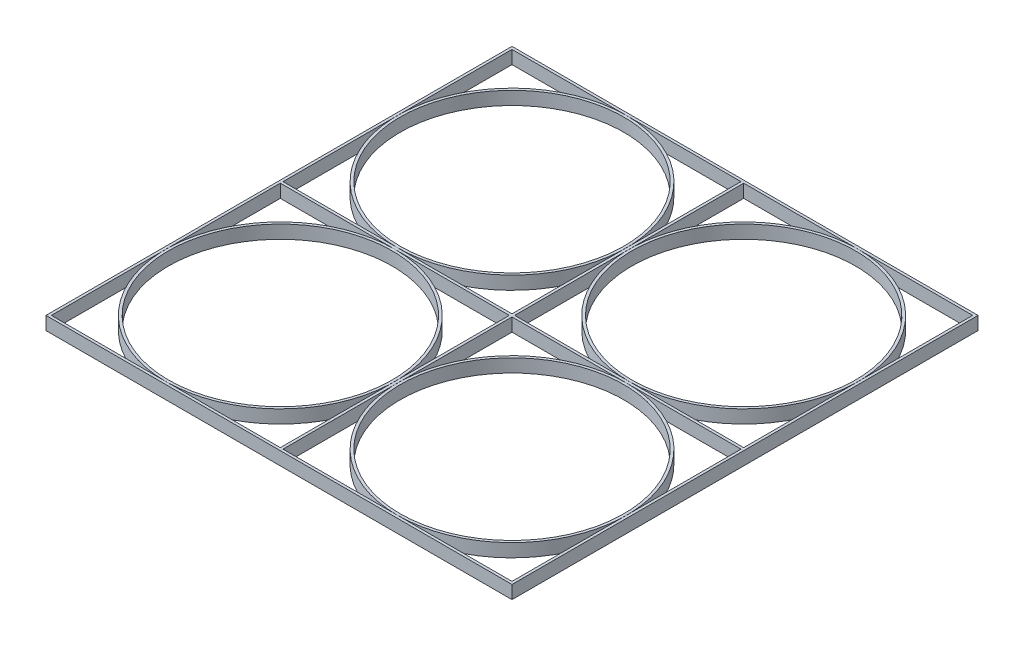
from build123d import *

# Parameters (mm, degrees)
SKETCH1_W           = 87.75
SKETCH1_H           = 87.75
SKETCH1_W_2         = 86.75
SKETCH1_H_2         = 86.75
BOSS_EXTRUDE1_DEPTH = 5
SKETCH2_R           = 43.375
SKETCH2_R_2         = 42.375
BOSS_EXTRUDE2_DEPTH = 5
LPATTERN2_COUNT     = 2
LPATTERN2_PITCH     = 87.75
LPATTERN3_COUNT     = 2
LPATTERN3_PITCH     = 87.75
SKETCH3_W           = 176.5
SKETCH3_H           = 176.5
SKETCH3_W_2         = 175.5
SKETCH3_H_2         = 175.5
EXTRUDE_THIN1_DEPTH = 5


with BuildPart() as part:
    # Sketch1 → Boss-Extrude1 (new body)
    with BuildSketch(Plane(origin=(0, 0, 0), x_dir=(1, 0, 0), z_dir=(0, 1, 0))):
        Rectangle(SKETCH1_W, SKETCH1_H)
        Rectangle(SKETCH1_W_2, SKETCH1_H_2, mode=Mode.SUBTRACT)
    extrude(amount=BOSS_EXTRUDE1_DEPTH)


with BuildPart() as body_2:
    # Sketch2 → Boss-Extrude2 (new body)
    with BuildSketch(Plane(origin=(0, 0, 0), x_dir=(1, 0, 0), z_dir=(0, 1, 0))):
        with Locations(Location((0, 0, 0), (0, 0, 270))):
            Circle(SKETCH2_R)
        with Locations(Location((0, 0, 0), (0, 0, 270))):
            Circle(SKETCH2_R_2, mode=Mode.SUBTRACT)
    extrude(amount=BOSS_EXTRUDE2_DEPTH)


with BuildPart() as lpattern2_1:
    # LPattern2: pattern copy
    add(body_2.part.moved(Location(Vector(1, 0, 0) * (1 * LPATTERN2_PITCH))))


with BuildPart() as lpattern2_2:
    # LPattern2: pattern copy
    add(part.part.moved(Location(Vector(1, 0, 0) * (1 * LPATTERN2_PITCH))))


with BuildPart() as lpattern3_1:
    # LPattern3: pattern copy
    add(part.part.moved(Location(Vector(0, 0, 1) * (1 * LPATTERN3_PITCH))))


with BuildPart() as lpattern3_2:
    # LPattern3: pattern copy
    add(body_2.part.moved(Location(Vector(0, 0, 1) * (1 * LPATTERN3_PITCH))))


with BuildPart() as lpattern3_3:
    # LPattern3: pattern copy
    add(lpattern2_2.part.moved(Location(Vector(0, 0, 1) * (1 * LPATTERN3_PITCH))))


with BuildPart() as lpattern3_4:
    # LPattern3: pattern copy
    add(lpattern2_1.part.moved(Location(Vector(0, 0, 1) * (1 * LPATTERN3_PITCH))))


with BuildPart() as part_1:
    add(part.part)

    add(lpattern2_2.part)  # Extrude-Thin1 merges LPattern2_2

    add(lpattern3_1.part)  # Extrude-Thin1 merges LPattern3_1

    add(lpattern3_3.part)  # Extrude-Thin1 merges LPattern3_3
    # Sketch3 → Extrude-Thin1 (add)
    with BuildSketch(Plane(origin=(0, 0, 0), x_dir=(1, 0, 0), z_dir=(0, 1, 0))):
        with Locations((43.875, -43.875)):
            Rectangle(SKETCH3_W, SKETCH3_H)
        with Locations((43.875, -43.875)):
            Rectangle(SKETCH3_W_2, SKETCH3_H_2, mode=Mode.SUBTRACT)
    extrude(amount=EXTRUDE_THIN1_DEPTH)


solid = Compound([body_2.part, lpattern2_1.part, lpattern3_2.part, lpattern3_4.part, part_1.part])
